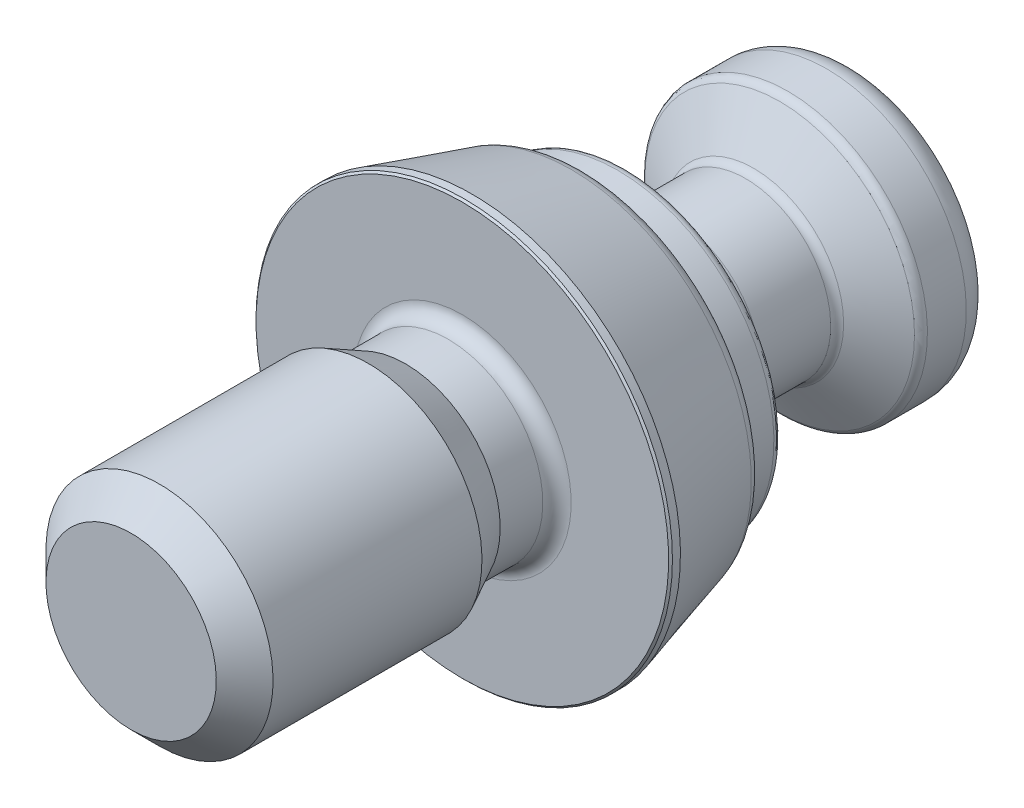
ISO-10303-21;
HEADER;
FILE_DESCRIPTION(('STEP AP214'),'2;1');
FILE_NAME('part.step','',(''),(''),'','','');
FILE_SCHEMA(('AUTOMOTIVE_DESIGN { 1 0 10303 214 1 1 1 1 }'));
ENDSEC;
DATA;
#1=APPLICATION_CONTEXT('core data for automotive mechanical design processes');
#2=APPLICATION_PROTOCOL_DEFINITION('international standard','automotive_design',2000,#1);
#3=PRODUCT_CONTEXT('',#1,'mechanical');
#4=PRODUCT('Part','Part','',(#3));
#5=PRODUCT_RELATED_PRODUCT_CATEGORY('part','',(#4));
#6=PRODUCT_DEFINITION_FORMATION('','',#4);
#7=PRODUCT_DEFINITION_CONTEXT('part definition',#1,'design');
#8=PRODUCT_DEFINITION('design','',#6,#7);
#9=PRODUCT_DEFINITION_SHAPE('','',#8);
#10=(LENGTH_UNIT() NAMED_UNIT(*) SI_UNIT(.MILLI.,.METRE.));
#11=(NAMED_UNIT(*) PLANE_ANGLE_UNIT() SI_UNIT($,.RADIAN.));
#12=(NAMED_UNIT(*) SI_UNIT($,.STERADIAN.) SOLID_ANGLE_UNIT());
#13=UNCERTAINTY_MEASURE_WITH_UNIT(LENGTH_MEASURE(1.E-05),#10,'distance_accuracy_value','');
#14=(GEOMETRIC_REPRESENTATION_CONTEXT(3) GLOBAL_UNCERTAINTY_ASSIGNED_CONTEXT((#13)) GLOBAL_UNIT_ASSIGNED_CONTEXT((#10,
#11,#12)) REPRESENTATION_CONTEXT('',''));
#15=CARTESIAN_POINT('',(0.,0.,0.));
#16=DIRECTION('',(0.,0.,1.));
#17=DIRECTION('',(1.,0.,0.));
#18=AXIS2_PLACEMENT_3D('',#15,#16,#17);
#19=CARTESIAN_POINT('',(0.,0.,-13.));
#20=DIRECTION('',(0.,0.,-1.));
#21=DIRECTION('',(0.,1.,0.));
#22=AXIS2_PLACEMENT_3D('',#19,#20,#21);
#23=CYLINDRICAL_SURFACE('',#22,16.5);
#24=CARTESIAN_POINT('',(0.,0.,-13.4));
#25=DIRECTION('',(0.,0.,1.));
#26=DIRECTION('',(0.,-1.,0.));
#27=AXIS2_PLACEMENT_3D('',#24,#25,#26);
#28=CIRCLE('',#27,16.5);
#29=CARTESIAN_POINT('',(0.,-16.5,-13.4000000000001));
#30=VERTEX_POINT('',#29);
#31=EDGE_CURVE('E22',#30,#30,#28,.F.);
#32=ORIENTED_EDGE('',*,*,#31,.T.);
#33=EDGE_LOOP('',(#32));
#34=FACE_BOUND('',#33,.T.);
#35=CARTESIAN_POINT('',(0.,0.,-16.4226497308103));
#36=DIRECTION('',(0.,0.,-1.));
#37=DIRECTION('',(0.,1.,0.));
#38=AXIS2_PLACEMENT_3D('',#35,#36,#37);
#39=CIRCLE('',#38,16.5);
#40=CARTESIAN_POINT('',(0.,16.5,-16.4226497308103));
#41=VERTEX_POINT('',#40);
#42=EDGE_CURVE('E126',#41,#41,#39,.F.);
#43=ORIENTED_EDGE('',*,*,#42,.T.);
#44=EDGE_LOOP('',(#43));
#45=FACE_BOUND('',#44,.T.);
#46=ADVANCED_FACE('F14',(#34,#45),#23,.T.);
#47=CARTESIAN_POINT('',(0.,0.,-13.));
#48=DIRECTION('',(0.,0.,1.));
#49=DIRECTION('',(0.,-1.,0.));
#50=AXIS2_PLACEMENT_3D('',#47,#48,#49);
#51=CYLINDRICAL_SURFACE('',#50,9.);
#52=CARTESIAN_POINT('',(0.,0.,-22.4848275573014));
#53=DIRECTION('',(0.,0.,1.));
#54=DIRECTION('',(0.,-1.,0.));
#55=AXIS2_PLACEMENT_3D('',#52,#53,#54);
#56=CIRCLE('',#55,9.);
#57=CARTESIAN_POINT('',(0.,-8.99999999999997,-22.4848275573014));
#58=VERTEX_POINT('',#57);
#59=EDGE_CURVE('E117',#58,#58,#56,.F.);
#60=ORIENTED_EDGE('',*,*,#59,.T.);
#61=EDGE_LOOP('',(#60));
#62=FACE_BOUND('',#61,.T.);
#63=CARTESIAN_POINT('',(0.,0.,-29.9226497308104));
#64=DIRECTION('',(0.,0.,1.));
#65=DIRECTION('',(0.,-1.,0.));
#66=AXIS2_PLACEMENT_3D('',#63,#64,#65);
#67=CIRCLE('',#66,9.);
#68=CARTESIAN_POINT('',(0.,-8.99999999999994,-29.9226497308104));
#69=VERTEX_POINT('',#68);
#70=EDGE_CURVE('E96',#69,#69,#67,.T.);
#71=ORIENTED_EDGE('',*,*,#70,.T.);
#72=EDGE_LOOP('',(#71));
#73=FACE_BOUND('',#72,.T.);
#74=ADVANCED_FACE('F229',(#62,#73),#51,.T.);
#75=CARTESIAN_POINT('',(0.,0.,-30.5));
#76=DIRECTION('',(0.,0.,-1.));
#77=DIRECTION('',(0.,1.,0.));
#78=AXIS2_PLACEMENT_3D('',#75,#76,#77);
#79=CONICAL_SURFACE('',#78,9.,1.0471975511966);
#80=CARTESIAN_POINT('',(0.,0.,-33.5310889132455));
#81=DIRECTION('',(0.,0.,1.));
#82=DIRECTION('',(0.,-1.,0.));
#83=AXIS2_PLACEMENT_3D('',#80,#81,#82);
#84=CIRCLE('',#83,14.25);
#85=CARTESIAN_POINT('',(0.,-14.2499999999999,-33.5310889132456));
#86=VERTEX_POINT('',#85);
#87=EDGE_CURVE('E102',#86,#86,#84,.T.);
#88=ORIENTED_EDGE('',*,*,#87,.T.);
#89=EDGE_LOOP('',(#88));
#90=FACE_BOUND('',#89,.T.);
#91=CARTESIAN_POINT('',(0.,0.,-30.7886751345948));
#92=DIRECTION('',(0.,0.,-1.));
#93=DIRECTION('',(0.,1.,0.));
#94=AXIS2_PLACEMENT_3D('',#91,#92,#93);
#95=CIRCLE('',#94,9.5);
#96=CARTESIAN_POINT('',(0.,9.50000000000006,-30.7886751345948));
#97=VERTEX_POINT('',#96);
#98=EDGE_CURVE('E99',#97,#97,#95,.T.);
#99=ORIENTED_EDGE('',*,*,#98,.T.);
#100=EDGE_LOOP('',(#99));
#101=FACE_BOUND('',#100,.T.);
#102=ADVANCED_FACE('F236',(#90,#101),#79,.T.);
#103=CARTESIAN_POINT('',(0.,0.,-13.));
#104=DIRECTION('',(0.,0.,1.));
#105=DIRECTION('',(0.,-1.,0.));
#106=AXIS2_PLACEMENT_3D('',#103,#104,#105);
#107=CYLINDRICAL_SURFACE('',#106,14.75);
#108=CARTESIAN_POINT('',(0.,0.,-38.5));
#109=DIRECTION('',(0.,0.,-1.));
#110=DIRECTION('',(0.,1.,0.));
#111=AXIS2_PLACEMENT_3D('',#108,#109,#110);
#112=CIRCLE('',#111,14.75);
#113=CARTESIAN_POINT('',(0.,14.7500000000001,-38.5));
#114=VERTEX_POINT('',#113);
#115=EDGE_CURVE('E108',#114,#114,#112,.F.);
#116=ORIENTED_EDGE('',*,*,#115,.T.);
#117=EDGE_LOOP('',(#116));
#118=FACE_BOUND('',#117,.T.);
#119=CARTESIAN_POINT('',(0.,0.,-34.39711431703));
#120=DIRECTION('',(0.,0.,-1.));
#121=DIRECTION('',(0.,1.,0.));
#122=AXIS2_PLACEMENT_3D('',#119,#120,#121);
#123=CIRCLE('',#122,14.75);
#124=CARTESIAN_POINT('',(0.,14.7500000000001,-34.39711431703));
#125=VERTEX_POINT('',#124);
#126=EDGE_CURVE('E105',#125,#125,#123,.T.);
#127=ORIENTED_EDGE('',*,*,#126,.T.);
#128=EDGE_LOOP('',(#127));
#129=FACE_BOUND('',#128,.T.);
#130=ADVANCED_FACE('F356',(#118,#129),#107,.T.);
#131=CARTESIAN_POINT('',(0.,0.,-17.));
#132=DIRECTION('',(0.,0.,1.));
#133=DIRECTION('',(0.,-1.,0.));
#134=AXIS2_PLACEMENT_3D('',#131,#132,#133);
#135=CONICAL_SURFACE('',#134,16.5,1.0471975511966);
#136=CARTESIAN_POINT('',(0.,0.,-17.2886751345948));
#137=DIRECTION('',(0.,0.,-1.));
#138=DIRECTION('',(0.,1.,0.));
#139=AXIS2_PLACEMENT_3D('',#136,#137,#138);
#140=CIRCLE('',#139,16.);
#141=CARTESIAN_POINT('',(0.,16.,-17.2886751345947));
#142=VERTEX_POINT('',#141);
#143=EDGE_CURVE('E129',#142,#142,#140,.T.);
#144=ORIENTED_EDGE('',*,*,#143,.T.);
#145=EDGE_LOOP('',(#144));
#146=FACE_BOUND('',#145,.T.);
#147=CARTESIAN_POINT('',(0.,0.,-20.7527767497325));
#148=DIRECTION('',(0.,0.,1.));
#149=DIRECTION('',(0.,-1.,0.));
#150=AXIS2_PLACEMENT_3D('',#147,#148,#149);
#151=CIRCLE('',#150,10.);
#152=CARTESIAN_POINT('',(0.,-9.99999999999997,-20.7527767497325));
#153=VERTEX_POINT('',#152);
#154=EDGE_CURVE('E114',#153,#153,#151,.T.);
#155=ORIENTED_EDGE('',*,*,#154,.T.);
#156=EDGE_LOOP('',(#155));
#157=FACE_BOUND('',#156,.T.);
#158=ADVANCED_FACE('F351',(#146,#157),#135,.T.);
#159=CARTESIAN_POINT('',(16.5,0.,-41.5));
#160=DIRECTION('',(0.,0.,-1.));
#161=DIRECTION('',(0.,1.,0.));
#162=AXIS2_PLACEMENT_3D('',#159,#160,#161);
#163=PLANE('',#162);
#164=CARTESIAN_POINT('',(0.,0.,-41.5));
#165=DIRECTION('',(0.,0.,1.));
#166=DIRECTION('',(0.,-1.,0.));
#167=AXIS2_PLACEMENT_3D('',#164,#165,#166);
#168=CIRCLE('',#167,5.);
#169=CARTESIAN_POINT('',(0.,-4.9999999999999,-41.5));
#170=VERTEX_POINT('',#169);
#171=EDGE_CURVE('E345',#170,#170,#168,.T.);
#172=ORIENTED_EDGE('',*,*,#171,.T.);
#173=EDGE_LOOP('',(#172));
#174=FACE_BOUND('',#173,.T.);
#175=CARTESIAN_POINT('',(0.,0.,-41.5));
#176=DIRECTION('',(0.,0.,-1.));
#177=DIRECTION('',(0.,1.,0.));
#178=AXIS2_PLACEMENT_3D('',#175,#176,#177);
#179=CIRCLE('',#178,11.75);
#180=CARTESIAN_POINT('',(0.,11.7500000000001,-41.5));
#181=VERTEX_POINT('',#180);
#182=EDGE_CURVE('E111',#181,#181,#179,.T.);
#183=ORIENTED_EDGE('',*,*,#182,.T.);
#184=EDGE_LOOP('',(#183));
#185=FACE_BOUND('',#184,.T.);
#186=ADVANCED_FACE('F243',(#174,#185),#163,.T.);
#187=CARTESIAN_POINT('',(0.,0.,-29.9226497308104));
#188=DIRECTION('',(0.,0.,1.));
#189=DIRECTION('',(0.,-1.,0.));
#190=AXIS2_PLACEMENT_3D('',#187,#188,#189);
#191=TOROIDAL_SURFACE('',#190,10.,1.);
#192=ORIENTED_EDGE('',*,*,#98,.F.);
#193=EDGE_LOOP('',(#192));
#194=FACE_BOUND('',#193,.T.);
#195=ORIENTED_EDGE('',*,*,#70,.F.);
#196=EDGE_LOOP('',(#195));
#197=FACE_BOUND('',#196,.T.);
#198=ADVANCED_FACE('F250',(#194,#197),#191,.F.);
#199=CARTESIAN_POINT('',(0.,0.,-34.39711431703));
#200=DIRECTION('',(0.,0.,-1.));
#201=DIRECTION('',(0.,1.,0.));
#202=AXIS2_PLACEMENT_3D('',#199,#200,#201);
#203=TOROIDAL_SURFACE('',#202,13.75,1.);
#204=ORIENTED_EDGE('',*,*,#126,.F.);
#205=EDGE_LOOP('',(#204));
#206=FACE_BOUND('',#205,.T.);
#207=ORIENTED_EDGE('',*,*,#87,.F.);
#208=EDGE_LOOP('',(#207));
#209=FACE_BOUND('',#208,.T.);
#210=ADVANCED_FACE('F253',(#206,#209),#203,.T.);
#211=CARTESIAN_POINT('',(0.,0.,-38.5));
#212=DIRECTION('',(0.,0.,-1.));
#213=DIRECTION('',(0.,1.,0.));
#214=AXIS2_PLACEMENT_3D('',#211,#212,#213);
#215=TOROIDAL_SURFACE('',#214,11.75,3.);
#216=ORIENTED_EDGE('',*,*,#182,.F.);
#217=EDGE_LOOP('',(#216));
#218=FACE_BOUND('',#217,.T.);
#219=ORIENTED_EDGE('',*,*,#115,.F.);
#220=EDGE_LOOP('',(#219));
#221=FACE_BOUND('',#220,.T.);
#222=ADVANCED_FACE('F257',(#218,#221),#215,.T.);
#223=CARTESIAN_POINT('',(0.,0.,-22.4848275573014));
#224=DIRECTION('',(0.,0.,1.));
#225=DIRECTION('',(0.,-1.,0.));
#226=AXIS2_PLACEMENT_3D('',#223,#224,#225);
#227=TOROIDAL_SURFACE('',#226,11.,2.);
#228=ORIENTED_EDGE('',*,*,#59,.F.);
#229=EDGE_LOOP('',(#228));
#230=FACE_BOUND('',#229,.T.);
#231=ORIENTED_EDGE('',*,*,#154,.F.);
#232=EDGE_LOOP('',(#231));
#233=FACE_BOUND('',#232,.T.);
#234=ADVANCED_FACE('F261',(#230,#233),#227,.F.);
#235=CARTESIAN_POINT('',(0.,0.,-16.4226497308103));
#236=DIRECTION('',(0.,0.,-1.));
#237=DIRECTION('',(0.,1.,0.));
#238=AXIS2_PLACEMENT_3D('',#235,#236,#237);
#239=TOROIDAL_SURFACE('',#238,15.5,1.);
#240=ORIENTED_EDGE('',*,*,#143,.F.);
#241=EDGE_LOOP('',(#240));
#242=FACE_BOUND('',#241,.T.);
#243=ORIENTED_EDGE('',*,*,#42,.F.);
#244=EDGE_LOOP('',(#243));
#245=FACE_BOUND('',#244,.T.);
#246=ADVANCED_FACE('F265',(#242,#245),#239,.T.);
#247=CARTESIAN_POINT('',(12.,0.,-13.));
#248=DIRECTION('',(0.,0.,1.));
#249=DIRECTION('',(0.,-1.,0.));
#250=AXIS2_PLACEMENT_3D('',#247,#248,#249);
#251=PLANE('',#250);
#252=CARTESIAN_POINT('',(0.,0.,-13.));
#253=DIRECTION('',(0.,0.,1.));
#254=DIRECTION('',(0.,-1.,0.));
#255=AXIS2_PLACEMENT_3D('',#252,#253,#254);
#256=CIRCLE('',#255,16.9);
#257=CARTESIAN_POINT('',(0.,-16.9,-13.0000000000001));
#258=VERTEX_POINT('',#257);
#259=EDGE_CURVE('E9',#258,#258,#256,.T.);
#260=ORIENTED_EDGE('',*,*,#259,.T.);
#261=EDGE_LOOP('',(#260));
#262=FACE_BOUND('',#261,.T.);
#263=CARTESIAN_POINT('',(0.,0.,-13.));
#264=DIRECTION('',(0.,0.,1.));
#265=DIRECTION('',(0.,-1.,0.));
#266=AXIS2_PLACEMENT_3D('',#263,#264,#265);
#267=CIRCLE('',#266,17.0652018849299);
#268=CARTESIAN_POINT('',(0.,-17.0652018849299,-13.0000000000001));
#269=VERTEX_POINT('',#268);
#270=EDGE_CURVE('E135',#269,#269,#267,.F.);
#271=ORIENTED_EDGE('',*,*,#270,.T.);
#272=EDGE_LOOP('',(#271));
#273=FACE_BOUND('',#272,.T.);
#274=ADVANCED_FACE('F273',(#262,#273),#251,.F.);
#275=CARTESIAN_POINT('',(0.,0.,-13.));
#276=DIRECTION('',(0.,0.,1.));
#277=DIRECTION('',(0.,-1.,0.));
#278=AXIS2_PLACEMENT_3D('',#275,#276,#277);
#279=CONICAL_SURFACE('',#278,18.5723099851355,0.279252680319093);
#280=CARTESIAN_POINT('',(0.,0.,-11.551274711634));
#281=DIRECTION('',(0.,0.,-1.));
#282=DIRECTION('',(0.,1.,0.));
#283=AXIS2_PLACEMENT_3D('',#280,#281,#282);
#284=CIRCLE('',#283,18.9877252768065);
#285=CARTESIAN_POINT('',(0.,18.9877252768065,-11.5512747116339));
#286=VERTEX_POINT('',#285);
#287=EDGE_CURVE('E132',#286,#286,#284,.F.);
#288=ORIENTED_EDGE('',*,*,#287,.T.);
#289=EDGE_LOOP('',(#288));
#290=FACE_BOUND('',#289,.T.);
#291=CARTESIAN_POINT('',(0.,0.,-1.04622433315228));
#292=DIRECTION('',(0.,0.,1.));
#293=DIRECTION('',(0.,-1.,0.));
#294=AXIS2_PLACEMENT_3D('',#291,#292,#293);
#295=CIRCLE('',#294,22.);
#296=CARTESIAN_POINT('',(0.,-22.,-1.04622433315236));
#297=VERTEX_POINT('',#296);
#298=EDGE_CURVE('E148',#297,#297,#295,.T.);
#299=ORIENTED_EDGE('',*,*,#298,.F.);
#300=EDGE_LOOP('',(#299));
#301=FACE_BOUND('',#300,.T.);
#302=ADVANCED_FACE('F303',(#290,#301),#279,.T.);
#303=CARTESIAN_POINT('',(0.,0.,-0.919969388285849));
#304=DIRECTION('',(0.,0.,1.));
#305=DIRECTION('',(0.,-1.,0.));
#306=AXIS2_PLACEMENT_3D('',#303,#304,#305);
#307=CYLINDRICAL_SURFACE('',#306,22.);
#308=CARTESIAN_POINT('',(0.,0.,-0.199999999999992));
#309=DIRECTION('',(0.,0.,-1.));
#310=DIRECTION('',(0.,1.,0.));
#311=AXIS2_PLACEMENT_3D('',#308,#309,#310);
#312=CIRCLE('',#311,22.);
#313=CARTESIAN_POINT('',(0.,22.,-0.199999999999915));
#314=VERTEX_POINT('',#313);
#315=EDGE_CURVE('E141',#314,#314,#312,.T.);
#316=ORIENTED_EDGE('',*,*,#315,.T.);
#317=EDGE_LOOP('',(#316));
#318=FACE_BOUND('',#317,.T.);
#319=ORIENTED_EDGE('',*,*,#298,.T.);
#320=EDGE_LOOP('',(#319));
#321=FACE_BOUND('',#320,.T.);
#322=ADVANCED_FACE('F295',(#318,#321),#307,.T.);
#323=CARTESIAN_POINT('',(12.,0.,0.));
#324=DIRECTION('',(0.,0.,-1.));
#325=DIRECTION('',(0.,1.,0.));
#326=AXIS2_PLACEMENT_3D('',#323,#324,#325);
#327=PLANE('',#326);
#328=CARTESIAN_POINT('',(0.,0.,0.));
#329=DIRECTION('',(0.,0.,-1.));
#330=DIRECTION('',(0.,1.,0.));
#331=AXIS2_PLACEMENT_3D('',#328,#329,#330);
#332=CIRCLE('',#331,11.5);
#333=CARTESIAN_POINT('',(0.,11.5,0.));
#334=VERTEX_POINT('',#333);
#335=EDGE_CURVE('E144',#334,#334,#332,.T.);
#336=ORIENTED_EDGE('',*,*,#335,.T.);
#337=EDGE_LOOP('',(#336));
#338=FACE_BOUND('',#337,.T.);
#339=CARTESIAN_POINT('',(0.,0.,0.));
#340=DIRECTION('',(0.,0.,-1.));
#341=DIRECTION('',(0.,1.,0.));
#342=AXIS2_PLACEMENT_3D('',#339,#340,#341);
#343=CIRCLE('',#342,21.8);
#344=CARTESIAN_POINT('',(0.,21.8,0.));
#345=VERTEX_POINT('',#344);
#346=EDGE_CURVE('E138',#345,#345,#343,.F.);
#347=ORIENTED_EDGE('',*,*,#346,.T.);
#348=EDGE_LOOP('',(#347));
#349=FACE_BOUND('',#348,.T.);
#350=ADVANCED_FACE('F279',(#338,#349),#327,.F.);
#351=CARTESIAN_POINT('',(0.,0.,-11.));
#352=DIRECTION('',(0.,0.,1.));
#353=DIRECTION('',(0.,-1.,0.));
#354=AXIS2_PLACEMENT_3D('',#351,#352,#353);
#355=TOROIDAL_SURFACE('',#354,17.0652018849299,2.);
#356=ORIENTED_EDGE('',*,*,#270,.F.);
#357=EDGE_LOOP('',(#356));
#358=FACE_BOUND('',#357,.T.);
#359=ORIENTED_EDGE('',*,*,#287,.F.);
#360=EDGE_LOOP('',(#359));
#361=FACE_BOUND('',#360,.T.);
#362=ADVANCED_FACE('F275',(#358,#361),#355,.T.);
#363=CARTESIAN_POINT('',(0.,0.,0.));
#364=DIRECTION('',(0.,0.,-1.));
#365=DIRECTION('',(0.,1.,0.));
#366=AXIS2_PLACEMENT_3D('',#363,#364,#365);
#367=CONICAL_SURFACE('',#366,21.8,0.785398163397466);
#368=ORIENTED_EDGE('',*,*,#315,.F.);
#369=EDGE_LOOP('',(#368));
#370=FACE_BOUND('',#369,.T.);
#371=ORIENTED_EDGE('',*,*,#346,.F.);
#372=EDGE_LOOP('',(#371));
#373=FACE_BOUND('',#372,.T.);
#374=ADVANCED_FACE('F278',(#370,#373),#367,.T.);
#375=CARTESIAN_POINT('',(0.,0.,-15.1189031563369));
#376=DIRECTION('',(0.,0.,-1.));
#377=DIRECTION('',(0.,1.,0.));
#378=AXIS2_PLACEMENT_3D('',#375,#376,#377);
#379=CYLINDRICAL_SURFACE('',#378,10.);
#380=CARTESIAN_POINT('',(0.,0.,1.5));
#381=DIRECTION('',(0.,0.,-1.));
#382=DIRECTION('',(0.,1.,0.));
#383=AXIS2_PLACEMENT_3D('',#380,#381,#382);
#384=CIRCLE('',#383,10.);
#385=CARTESIAN_POINT('',(0.,9.99999999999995,1.50000000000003));
#386=VERTEX_POINT('',#385);
#387=EDGE_CURVE('E75',#386,#386,#384,.F.);
#388=ORIENTED_EDGE('',*,*,#387,.T.);
#389=EDGE_LOOP('',(#388));
#390=FACE_BOUND('',#389,.T.);
#391=CARTESIAN_POINT('',(0.,0.,6.));
#392=DIRECTION('',(0.,0.,-1.));
#393=DIRECTION('',(0.,1.,0.));
#394=AXIS2_PLACEMENT_3D('',#391,#392,#393);
#395=CIRCLE('',#394,10.);
#396=CARTESIAN_POINT('',(0.,9.99999999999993,6.00000000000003));
#397=VERTEX_POINT('',#396);
#398=EDGE_CURVE('E81',#397,#397,#395,.T.);
#399=ORIENTED_EDGE('',*,*,#398,.T.);
#400=EDGE_LOOP('',(#399));
#401=FACE_BOUND('',#400,.T.);
#402=ADVANCED_FACE('F282',(#390,#401),#379,.T.);
#403=CARTESIAN_POINT('',(0.,0.,10.9065262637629));
#404=DIRECTION('',(0.,0.,1.));
#405=DIRECTION('',(0.,-1.,0.));
#406=AXIS2_PLACEMENT_3D('',#403,#404,#405);
#407=CONICAL_SURFACE('',#406,12.5,0.471238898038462);
#408=CARTESIAN_POINT('',(0.,0.,9.92522101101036));
#409=DIRECTION('',(0.,0.,1.));
#410=DIRECTION('',(0.,-1.,0.));
#411=AXIS2_PLACEMENT_3D('',#408,#409,#410);
#412=CIRCLE('',#411,12.);
#413=CARTESIAN_POINT('',(0.,-12.0000000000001,9.92522101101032));
#414=VERTEX_POINT('',#413);
#415=EDGE_CURVE('E145',#414,#414,#412,.F.);
#416=ORIENTED_EDGE('',*,*,#415,.T.);
#417=EDGE_LOOP('',(#416));
#418=FACE_BOUND('',#417,.T.);
#419=ORIENTED_EDGE('',*,*,#398,.F.);
#420=EDGE_LOOP('',(#419));
#421=FACE_BOUND('',#420,.T.);
#422=ADVANCED_FACE('F167',(#418,#421),#407,.T.);
#423=CARTESIAN_POINT('',(0.,-1.6759110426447E-13,35.));
#424=DIRECTION('',(0.,0.,1.));
#425=DIRECTION('',(0.,-1.,0.));
#426=AXIS2_PLACEMENT_3D('',#423,#424,#425);
#427=PLANE('',#426);
#428=CARTESIAN_POINT('',(0.,-1.6759110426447E-13,35.));
#429=DIRECTION('',(0.,0.,1.));
#430=DIRECTION('',(0.,-1.,0.));
#431=AXIS2_PLACEMENT_3D('',#428,#429,#430);
#432=CIRCLE('',#431,9.);
#433=CARTESIAN_POINT('',(0.,-9.00000000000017,35.));
#434=VERTEX_POINT('',#433);
#435=EDGE_CURVE('E123',#434,#434,#432,.T.);
#436=ORIENTED_EDGE('',*,*,#435,.T.);
#437=EDGE_LOOP('',(#436));
#438=FACE_BOUND('',#437,.T.);
#439=ADVANCED_FACE('F269',(#438),#427,.T.);
#440=CARTESIAN_POINT('',(0.,-1.57116660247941E-13,32.));
#441=DIRECTION('',(0.,0.,-1.));
#442=DIRECTION('',(0.,1.,0.));
#443=AXIS2_PLACEMENT_3D('',#440,#441,#442);
#444=CONICAL_SURFACE('',#443,12.,0.785398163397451);
#445=ORIENTED_EDGE('',*,*,#435,.F.);
#446=EDGE_LOOP('',(#445));
#447=FACE_BOUND('',#446,.T.);
#448=CARTESIAN_POINT('',(0.,-1.57116660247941E-13,32.));
#449=DIRECTION('',(0.,0.,1.));
#450=DIRECTION('',(0.,-1.,0.));
#451=AXIS2_PLACEMENT_3D('',#448,#449,#450);
#452=CIRCLE('',#451,12.);
#453=CARTESIAN_POINT('',(0.,-12.0000000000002,32.));
#454=VERTEX_POINT('',#453);
#455=EDGE_CURVE('E120',#454,#454,#452,.F.);
#456=ORIENTED_EDGE('',*,*,#455,.F.);
#457=EDGE_LOOP('',(#456));
#458=FACE_BOUND('',#457,.T.);
#459=ADVANCED_FACE('F248',(#447,#458),#444,.T.);
#460=CARTESIAN_POINT('',(0.,0.,-13.));
#461=DIRECTION('',(0.,0.,-1.));
#462=DIRECTION('',(0.,1.,0.));
#463=AXIS2_PLACEMENT_3D('',#460,#461,#462);
#464=CYLINDRICAL_SURFACE('',#463,12.);
#465=ORIENTED_EDGE('',*,*,#415,.F.);
#466=EDGE_LOOP('',(#465));
#467=FACE_BOUND('',#466,.T.);
#468=ORIENTED_EDGE('',*,*,#455,.T.);
#469=EDGE_LOOP('',(#468));
#470=FACE_BOUND('',#469,.T.);
#471=ADVANCED_FACE('F245',(#467,#470),#464,.T.);
#472=CARTESIAN_POINT('',(0.,0.,1.5));
#473=DIRECTION('',(0.,0.,-1.));
#474=DIRECTION('',(0.,1.,0.));
#475=AXIS2_PLACEMENT_3D('',#472,#473,#474);
#476=TOROIDAL_SURFACE('',#475,11.5,1.5);
#477=ORIENTED_EDGE('',*,*,#387,.F.);
#478=EDGE_LOOP('',(#477));
#479=FACE_BOUND('',#478,.T.);
#480=ORIENTED_EDGE('',*,*,#335,.F.);
#481=EDGE_LOOP('',(#480));
#482=FACE_BOUND('',#481,.T.);
#483=ADVANCED_FACE('F165',(#479,#482),#476,.F.);
#484=CARTESIAN_POINT('',(0.,0.,-41.5));
#485=DIRECTION('',(0.,0.,-1.));
#486=DIRECTION('',(0.,1.,0.));
#487=AXIS2_PLACEMENT_3D('',#484,#485,#486);
#488=CONICAL_SURFACE('',#487,5.,1.0471975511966);
#489=ORIENTED_EDGE('',*,*,#171,.F.);
#490=EDGE_LOOP('',(#489));
#491=FACE_BOUND('',#490,.T.);
#492=CARTESIAN_POINT('',(4.61891762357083,-0.000199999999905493,-41.2799819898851));
#493=CARTESIAN_POINT('',(4.51743148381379,0.175579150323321,-41.2213676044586));
#494=CARTESIAN_POINT('',(4.4150693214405,0.352875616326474,-41.1680600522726));
#495=CARTESIAN_POINT('',(4.20857250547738,0.710538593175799,-41.0750114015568));
#496=CARTESIAN_POINT('',(4.10443418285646,0.890911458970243,-41.0353032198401));
#497=CARTESIAN_POINT('',(3.89744813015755,1.24942181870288,-40.9734919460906));
#498=CARTESIAN_POINT('',(3.79463224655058,1.42750415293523,-40.9509774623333));
#499=CARTESIAN_POINT('',(3.58851671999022,1.7845067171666,-40.9241003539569));
#500=CARTESIAN_POINT('',(3.48521782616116,1.96342564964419,-40.9197154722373));
#501=CARTESIAN_POINT('',(3.29219970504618,2.29774284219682,-40.9288398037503));
#502=CARTESIAN_POINT('',(3.20245157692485,2.45319115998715,-40.9401086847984));
#503=CARTESIAN_POINT('',(3.02354002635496,2.76307505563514,-40.9758237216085));
#504=CARTESIAN_POINT('',(2.93437722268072,2.91750956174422,-41.0002820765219));
#505=CARTESIAN_POINT('',(2.75509682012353,3.22803232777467,-41.0614257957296));
#506=CARTESIAN_POINT('',(2.66500191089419,3.38408128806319,-41.0983703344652));
#507=CARTESIAN_POINT('',(2.486155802,3.69385183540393,-41.1822198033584));
#508=CARTESIAN_POINT('',(2.39740231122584,3.84757739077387,-41.2291050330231));
#509=CARTESIAN_POINT('',(2.30928560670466,4.00020000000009,-41.2799819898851));
#510=B_SPLINE_CURVE_WITH_KNOTS('',3,(#492,#493,#494,#495,#496,#497,#498,#499,#500,#501,#502,
#503,#504,#505,#506,#507,#508,#509),.UNSPECIFIED.,.F.,.F.,(4,2,2,2,2,2,2,2,4),(0.,
0.634047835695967,1.26961969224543,1.88946157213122,2.50854226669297,3.04757825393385,
3.58711366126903,4.13861653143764,4.68903648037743),.UNSPECIFIED.);
#511=CARTESIAN_POINT('',(4.61880215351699,0.,-41.2799153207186));
#512=VERTEX_POINT('',#511);
#513=CARTESIAN_POINT('',(2.30940107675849,4.00000000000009,-41.2799153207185));
#514=VERTEX_POINT('',#513);
#515=EDGE_CURVE('E69',#512,#514,#510,.T.);
#516=ORIENTED_EDGE('',*,*,#515,.T.);
#517=CARTESIAN_POINT('',(-6.11536351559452,4.0000000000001,-42.8321612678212));
#518=CARTESIAN_POINT('',(-5.94136455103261,4.0000000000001,-42.7481138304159));
#519=CARTESIAN_POINT('',(-5.76695654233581,4.00000000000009,-42.6648982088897));
#520=CARTESIAN_POINT('',(-5.41710453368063,4.00000000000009,-42.5006003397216));
#521=CARTESIAN_POINT('',(-5.24166036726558,4.00000000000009,-42.4195184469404));
#522=CARTESIAN_POINT('',(-4.88857129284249,4.00000000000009,-42.2595308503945));
#523=CARTESIAN_POINT('',(-4.71091953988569,4.00000000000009,-42.1806401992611));
#524=CARTESIAN_POINT('',(-4.35417172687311,4.00000000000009,-42.0262076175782));
#525=CARTESIAN_POINT('',(-4.17507573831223,4.00000000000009,-41.9506655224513));
#526=CARTESIAN_POINT('',(-3.80974659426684,4.00000000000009,-41.8016107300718));
#527=CARTESIAN_POINT('',(-3.623460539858,4.00000000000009,-41.7282269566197));
#528=CARTESIAN_POINT('',(-3.24867678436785,4.00000000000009,-41.5872295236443));
#529=CARTESIAN_POINT('',(-3.06017883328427,4.00000000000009,-41.5196165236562));
#530=CARTESIAN_POINT('',(-2.68105362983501,4.00000000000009,-41.3920002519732));
#531=CARTESIAN_POINT('',(-2.49043188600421,4.00000000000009,-41.3319807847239));
#532=CARTESIAN_POINT('',(-2.1064563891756,4.00000000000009,-41.2215351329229));
#533=CARTESIAN_POINT('',(-1.91310354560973,4.00000000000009,-41.1711058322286));
#534=CARTESIAN_POINT('',(-1.52459990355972,4.00000000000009,-41.0825776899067));
#535=CARTESIAN_POINT('',(-1.32946366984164,4.00000000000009,-41.0444161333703));
#536=CARTESIAN_POINT('',(-0.936859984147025,4.00000000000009,-40.9826444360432));
#537=CARTESIAN_POINT('',(-0.739392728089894,4.00000000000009,-40.9590330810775));
#538=CARTESIAN_POINT('',(-0.345654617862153,4.00000000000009,-40.9285556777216));
#539=CARTESIAN_POINT('',(-0.149400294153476,4.00000000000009,-40.9214813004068));
#540=CARTESIAN_POINT('',(0.24300822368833,4.00000000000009,-40.9241343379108));
#541=CARTESIAN_POINT('',(0.439162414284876,4.00000000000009,-40.9338623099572));
#542=CARTESIAN_POINT('',(0.774833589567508,4.00000000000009,-40.9642118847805));
#543=CARTESIAN_POINT('',(0.914717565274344,4.00000000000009,-40.9809861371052));
#544=CARTESIAN_POINT('',(1.19339686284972,4.00000000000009,-41.0219863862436));
#545=CARTESIAN_POINT('',(1.33219202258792,4.00000000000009,-41.0462134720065));
#546=CARTESIAN_POINT('',(1.74679493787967,4.00000000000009,-41.1287935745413));
#547=CARTESIAN_POINT('',(2.02065290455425,4.00000000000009,-41.1970283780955));
#548=CARTESIAN_POINT('',(2.43006674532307,4.00000000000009,-41.314532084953));
#549=CARTESIAN_POINT('',(2.56776398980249,4.00000000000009,-41.3567577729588));
#550=CARTESIAN_POINT('',(2.84181962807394,4.00000000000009,-41.4453888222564));
#551=CARTESIAN_POINT('',(2.97817801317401,4.00000000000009,-41.4917942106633));
#552=CARTESIAN_POINT('',(3.24960349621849,4.00000000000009,-41.5880571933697));
#553=CARTESIAN_POINT('',(3.38467104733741,4.00000000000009,-41.6379135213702));
#554=CARTESIAN_POINT('',(3.65370081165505,4.00000000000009,-41.7405124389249));
#555=CARTESIAN_POINT('',(3.78766303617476,4.00000000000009,-41.7932549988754));
#556=CARTESIAN_POINT('',(4.09701986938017,4.00000000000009,-41.9182840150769));
#557=CARTESIAN_POINT('',(4.27205588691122,4.00000000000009,-41.991455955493));
#558=CARTESIAN_POINT('',(4.62071132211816,4.00000000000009,-42.141108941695));
#559=CARTESIAN_POINT('',(4.79433066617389,4.00000000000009,-42.2175901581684));
#560=CARTESIAN_POINT('',(5.14040670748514,4.00000000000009,-42.373213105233));
#561=CARTESIAN_POINT('',(5.31286319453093,4.00000000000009,-42.4523553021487));
#562=CARTESIAN_POINT('',(5.65677659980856,4.00000000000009,-42.6127855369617));
#563=CARTESIAN_POINT('',(5.82823349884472,4.00000000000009,-42.6940736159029));
#564=CARTESIAN_POINT('',(6.34165551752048,4.00000000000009,-42.9406928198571));
#565=CARTESIAN_POINT('',(6.68236404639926,4.00000000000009,-43.1086386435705));
#566=CARTESIAN_POINT('',(7.36139047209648,4.0000000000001,-43.4492937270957));
#567=CARTESIAN_POINT('',(7.69970828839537,4.0000000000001,-43.6220031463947));
#568=CARTESIAN_POINT('',(8.34749653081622,4.0000000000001,-43.9568309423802));
#569=CARTESIAN_POINT('',(8.65710289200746,4.0000000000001,-44.1186868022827));
#570=CARTESIAN_POINT('',(9.27517825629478,4.0000000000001,-44.4445752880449));
#571=CARTESIAN_POINT('',(9.5836472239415,4.0000000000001,-44.6086079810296));
#572=CARTESIAN_POINT('',(10.1989977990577,4.0000000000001,-44.937968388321));
#573=CARTESIAN_POINT('',(10.5058814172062,4.0000000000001,-45.1032923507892));
#574=CARTESIAN_POINT('',(11.11891782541,4.0000000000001,-45.4352539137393));
#575=CARTESIAN_POINT('',(11.4250706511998,4.0000000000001,-45.6018914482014));
#576=CARTESIAN_POINT('',(11.7309525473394,4.0000000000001,-45.7690213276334));
#577=B_SPLINE_CURVE_WITH_KNOTS('',3,(#517,#518,#519,#520,#521,#522,#523,#524,#525,#526,#527,
#528,#529,#530,#531,#532,#533,#534,#535,#536,#537,#538,#539,#540,#541,#542,#543,#544,#545,#546,
#547,#548,#549,#550,#551,#552,#553,#554,#555,#556,#557,#558,#559,#560,#561,#562,#563,#564,#565,
#566,#567,#568,#569,#570,#571,#572,#573,#574,#575,#576),.UNSPECIFIED.,.F.,.F.,(4,2,2,2,2,2,2,2,
2,2,2,2,2,2,2,2,2,2,2,2,2,2,2,2,2,2,2,2,2,4),(0.,0.579711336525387,1.15951848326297,
1.74263314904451,2.3257191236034,2.92630247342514,3.52695437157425,4.12630278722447,
4.72545612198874,5.32149588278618,5.91748589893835,6.50592633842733,7.09438629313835,
7.51683805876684,7.93935157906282,8.78488063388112,9.21692534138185,9.64897285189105,
10.0808626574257,10.512748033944,11.0818474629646,11.650976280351,12.220205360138,
12.7894453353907,13.9289401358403,15.0684731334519,16.1165460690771,17.1646513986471,
18.2103945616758,19.2560854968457),.UNSPECIFIED.);
#578=CARTESIAN_POINT('',(-2.30940107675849,4.00000000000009,-41.2799153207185));
#579=VERTEX_POINT('',#578);
#580=EDGE_CURVE('E82',#514,#579,#577,.F.);
#581=ORIENTED_EDGE('',*,*,#580,.T.);
#582=CARTESIAN_POINT('',(-2.30928560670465,4.00020000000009,-41.2799819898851));
#583=CARTESIAN_POINT('',(-2.41077174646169,3.82442084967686,-41.2213676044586));
#584=CARTESIAN_POINT('',(-2.51313390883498,3.64712438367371,-41.1680600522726));
#585=CARTESIAN_POINT('',(-2.7196307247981,3.28946140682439,-41.0750114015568));
#586=CARTESIAN_POINT('',(-2.82376904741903,3.10908854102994,-41.0353032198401));
#587=CARTESIAN_POINT('',(-3.03075510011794,2.7505781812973,-40.9734919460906));
#588=CARTESIAN_POINT('',(-3.1335709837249,2.57249584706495,-40.9509774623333));
#589=CARTESIAN_POINT('',(-3.33968651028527,2.21549328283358,-40.9241003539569));
#590=CARTESIAN_POINT('',(-3.44298540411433,2.03657435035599,-40.9197154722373));
#591=CARTESIAN_POINT('',(-3.63600352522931,1.70225715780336,-40.9288398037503));
#592=CARTESIAN_POINT('',(-3.72575165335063,1.54680884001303,-40.9401086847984));
#593=CARTESIAN_POINT('',(-3.90466320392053,1.23692494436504,-40.9758237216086));
#594=CARTESIAN_POINT('',(-3.99382600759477,1.08249043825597,-41.0002820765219));
#595=CARTESIAN_POINT('',(-4.17310641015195,0.771967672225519,-41.0614257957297));
#596=CARTESIAN_POINT('',(-4.2632013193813,0.615918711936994,-41.0983703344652));
#597=CARTESIAN_POINT('',(-4.44204742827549,0.306148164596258,-41.1822198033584));
#598=CARTESIAN_POINT('',(-4.53080091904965,0.152422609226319,-41.2291050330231));
#599=CARTESIAN_POINT('',(-4.61891762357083,-0.000199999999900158,-41.2799819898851));
#600=B_SPLINE_CURVE_WITH_KNOTS('',3,(#582,#583,#584,#585,#586,#587,#588,#589,#590,#591,#592,
#593,#594,#595,#596,#597,#598,#599),.UNSPECIFIED.,.F.,.F.,(4,2,2,2,2,2,2,2,4),(0.,
0.634047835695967,1.26961969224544,1.88946157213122,2.50854226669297,3.04757825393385,
3.58711366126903,4.13861653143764,4.68903648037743),.UNSPECIFIED.);
#601=CARTESIAN_POINT('',(-4.61880215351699,1.00248245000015E-13,-41.2799153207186));
#602=VERTEX_POINT('',#601);
#603=EDGE_CURVE('E188',#579,#602,#600,.T.);
#604=ORIENTED_EDGE('',*,*,#603,.T.);
#605=CARTESIAN_POINT('',(-4.61891762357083,0.000200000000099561,-41.2799819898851));
#606=CARTESIAN_POINT('',(-4.51743148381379,-0.175579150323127,-41.2213676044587));
#607=CARTESIAN_POINT('',(-4.4150693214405,-0.352875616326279,-41.1680600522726));
#608=CARTESIAN_POINT('',(-4.20857250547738,-0.710538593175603,-41.0750114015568));
#609=CARTESIAN_POINT('',(-4.10443418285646,-0.890911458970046,-41.0353032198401));
#610=CARTESIAN_POINT('',(-3.89744813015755,-1.24942181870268,-40.9734919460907));
#611=CARTESIAN_POINT('',(-3.79463224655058,-1.42750415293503,-40.9509774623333));
#612=CARTESIAN_POINT('',(-3.58851671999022,-1.7845067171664,-40.924100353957));
#613=CARTESIAN_POINT('',(-3.48521782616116,-1.96342564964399,-40.9197154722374));
#614=CARTESIAN_POINT('',(-3.29219970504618,-2.29774284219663,-40.9288398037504));
#615=CARTESIAN_POINT('',(-3.20245157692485,-2.45319115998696,-40.9401086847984));
#616=CARTESIAN_POINT('',(-3.02354002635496,-2.76307505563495,-40.9758237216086));
#617=CARTESIAN_POINT('',(-2.93437722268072,-2.91750956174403,-41.0002820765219));
#618=CARTESIAN_POINT('',(-2.75509682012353,-3.22803232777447,-41.0614257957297));
#619=CARTESIAN_POINT('',(-2.66500191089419,-3.38408128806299,-41.0983703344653));
#620=CARTESIAN_POINT('',(-2.486155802,-3.69385183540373,-41.1822198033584));
#621=CARTESIAN_POINT('',(-2.39740231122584,-3.84757739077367,-41.2291050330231));
#622=CARTESIAN_POINT('',(-2.30928560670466,-4.00019999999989,-41.2799819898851));
#623=B_SPLINE_CURVE_WITH_KNOTS('',3,(#605,#606,#607,#608,#609,#610,#611,#612,#613,#614,#615,
#616,#617,#618,#619,#620,#621,#622),.UNSPECIFIED.,.F.,.F.,(4,2,2,2,2,2,2,2,4),(0.,
0.634047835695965,1.26961969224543,1.88946157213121,2.50854226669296,3.04757825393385,
3.58711366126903,4.13861653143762,4.68903648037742),.UNSPECIFIED.);
#624=CARTESIAN_POINT('',(-2.30940107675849,-3.99999999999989,-41.2799153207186));
#625=VERTEX_POINT('',#624);
#626=EDGE_CURVE('E181',#602,#625,#623,.T.);
#627=ORIENTED_EDGE('',*,*,#626,.T.);
#628=CARTESIAN_POINT('',(-6.11536351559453,-3.99999999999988,-42.8321612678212));
#629=CARTESIAN_POINT('',(-5.94136455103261,-3.99999999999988,-42.7481138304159));
#630=CARTESIAN_POINT('',(-5.7669565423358,-3.99999999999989,-42.6648982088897));
#631=CARTESIAN_POINT('',(-5.41710453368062,-3.99999999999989,-42.5006003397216));
#632=CARTESIAN_POINT('',(-5.24166036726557,-3.99999999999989,-42.4195184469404));
#633=CARTESIAN_POINT('',(-4.88857129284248,-3.99999999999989,-42.2595308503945));
#634=CARTESIAN_POINT('',(-4.71091953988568,-3.99999999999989,-42.1806401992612));
#635=CARTESIAN_POINT('',(-4.35417172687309,-3.99999999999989,-42.0262076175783));
#636=CARTESIAN_POINT('',(-4.17507573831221,-3.99999999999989,-41.9506655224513));
#637=CARTESIAN_POINT('',(-3.80974659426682,-3.99999999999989,-41.8016107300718));
#638=CARTESIAN_POINT('',(-3.62346053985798,-3.99999999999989,-41.7282269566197));
#639=CARTESIAN_POINT('',(-3.24867678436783,-3.99999999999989,-41.5872295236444));
#640=CARTESIAN_POINT('',(-3.06017883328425,-3.99999999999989,-41.5196165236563));
#641=CARTESIAN_POINT('',(-2.681053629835,-3.99999999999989,-41.3920002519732));
#642=CARTESIAN_POINT('',(-2.4904318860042,-3.99999999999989,-41.331980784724));
#643=CARTESIAN_POINT('',(-2.10645638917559,-3.99999999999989,-41.2215351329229));
#644=CARTESIAN_POINT('',(-1.91310354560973,-3.9999999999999,-41.1711058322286));
#645=CARTESIAN_POINT('',(-1.52459990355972,-3.9999999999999,-41.0825776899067));
#646=CARTESIAN_POINT('',(-1.32946366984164,-3.99999999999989,-41.0444161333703));
#647=CARTESIAN_POINT('',(-0.936859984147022,-3.99999999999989,-40.9826444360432));
#648=CARTESIAN_POINT('',(-0.739392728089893,-3.99999999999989,-40.9590330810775));
#649=CARTESIAN_POINT('',(-0.345654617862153,-3.99999999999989,-40.9285556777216));
#650=CARTESIAN_POINT('',(-0.149400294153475,-3.99999999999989,-40.9214813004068));
#651=CARTESIAN_POINT('',(0.24300822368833,-3.99999999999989,-40.9241343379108));
#652=CARTESIAN_POINT('',(0.439162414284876,-3.9999999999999,-40.9338623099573));
#653=CARTESIAN_POINT('',(0.774833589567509,-3.9999999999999,-40.9642118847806));
#654=CARTESIAN_POINT('',(0.914717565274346,-3.99999999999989,-40.9809861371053));
#655=CARTESIAN_POINT('',(1.19339686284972,-3.99999999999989,-41.0219863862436));
#656=CARTESIAN_POINT('',(1.33219202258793,-3.99999999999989,-41.0462134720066));
#657=CARTESIAN_POINT('',(1.74679493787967,-3.99999999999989,-41.1287935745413));
#658=CARTESIAN_POINT('',(2.02065290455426,-3.99999999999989,-41.1970283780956));
#659=CARTESIAN_POINT('',(2.43006674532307,-3.99999999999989,-41.314532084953));
#660=CARTESIAN_POINT('',(2.56776398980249,-3.99999999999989,-41.3567577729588));
#661=CARTESIAN_POINT('',(2.84181962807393,-3.99999999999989,-41.4453888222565));
#662=CARTESIAN_POINT('',(2.97817801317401,-3.99999999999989,-41.4917942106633));
#663=CARTESIAN_POINT('',(3.24960349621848,-3.99999999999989,-41.5880571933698));
#664=CARTESIAN_POINT('',(3.38467104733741,-3.99999999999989,-41.6379135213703));
#665=CARTESIAN_POINT('',(3.65370081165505,-3.99999999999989,-41.740512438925));
#666=CARTESIAN_POINT('',(3.78766303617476,-3.99999999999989,-41.7932549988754));
#667=CARTESIAN_POINT('',(4.09701986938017,-3.99999999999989,-41.9182840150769));
#668=CARTESIAN_POINT('',(4.27205588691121,-3.99999999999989,-41.991455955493));
#669=CARTESIAN_POINT('',(4.62071132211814,-3.99999999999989,-42.141108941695));
#670=CARTESIAN_POINT('',(4.79433066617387,-3.99999999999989,-42.2175901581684));
#671=CARTESIAN_POINT('',(5.14040670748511,-3.99999999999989,-42.3732131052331));
#672=CARTESIAN_POINT('',(5.31286319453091,-3.99999999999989,-42.4523553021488));
#673=CARTESIAN_POINT('',(5.65677659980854,-3.99999999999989,-42.6127855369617));
#674=CARTESIAN_POINT('',(5.8282334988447,-3.99999999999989,-42.6940736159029));
#675=CARTESIAN_POINT('',(6.34165551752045,-3.99999999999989,-42.9406928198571));
#676=CARTESIAN_POINT('',(6.68236404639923,-3.99999999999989,-43.1086386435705));
#677=CARTESIAN_POINT('',(7.36139047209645,-3.99999999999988,-43.4492937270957));
#678=CARTESIAN_POINT('',(7.69970828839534,-3.99999999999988,-43.6220031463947));
#679=CARTESIAN_POINT('',(8.34749653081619,-3.99999999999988,-43.9568309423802));
#680=CARTESIAN_POINT('',(8.65710289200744,-3.99999999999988,-44.1186868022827));
#681=CARTESIAN_POINT('',(9.27517825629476,-3.99999999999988,-44.4445752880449));
#682=CARTESIAN_POINT('',(9.58364722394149,-3.99999999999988,-44.6086079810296));
#683=CARTESIAN_POINT('',(10.1989977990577,-3.99999999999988,-44.937968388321));
#684=CARTESIAN_POINT('',(10.5058814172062,-3.99999999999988,-45.1032923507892));
#685=CARTESIAN_POINT('',(11.11891782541,-3.99999999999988,-45.4352539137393));
#686=CARTESIAN_POINT('',(11.4250706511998,-3.99999999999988,-45.6018914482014));
#687=CARTESIAN_POINT('',(11.7309525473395,-3.99999999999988,-45.7690213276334));
#688=B_SPLINE_CURVE_WITH_KNOTS('',3,(#628,#629,#630,#631,#632,#633,#634,#635,#636,#637,#638,
#639,#640,#641,#642,#643,#644,#645,#646,#647,#648,#649,#650,#651,#652,#653,#654,#655,#656,#657,
#658,#659,#660,#661,#662,#663,#664,#665,#666,#667,#668,#669,#670,#671,#672,#673,#674,#675,#676,
#677,#678,#679,#680,#681,#682,#683,#684,#685,#686,#687),.UNSPECIFIED.,.F.,.F.,(4,2,2,2,2,2,2,2,
2,2,2,2,2,2,2,2,2,2,2,2,2,2,2,2,2,2,2,2,2,4),(0.,0.579711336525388,1.15951848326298,
1.74263314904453,2.32571912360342,2.92630247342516,3.52695437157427,4.12630278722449,
4.72545612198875,5.32149588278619,5.91748589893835,6.50592633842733,7.09438629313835,
7.51683805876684,7.93935157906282,8.78488063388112,9.21692534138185,9.64897285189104,
10.0808626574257,10.512748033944,11.0818474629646,11.6509762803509,12.220205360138,
12.7894453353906,13.9289401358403,15.0684731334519,16.1165460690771,17.1646513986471,
18.2103945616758,19.2560854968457),.UNSPECIFIED.);
#689=CARTESIAN_POINT('',(2.30940107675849,-3.9999999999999,-41.2799153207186));
#690=VERTEX_POINT('',#689);
#691=EDGE_CURVE('E29',#625,#690,#688,.T.);
#692=ORIENTED_EDGE('',*,*,#691,.T.);
#693=CARTESIAN_POINT('',(2.30928560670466,-4.00019999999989,-41.2799819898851));
#694=CARTESIAN_POINT('',(2.4107717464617,-3.82442084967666,-41.2213676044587));
#695=CARTESIAN_POINT('',(2.51313390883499,-3.64712438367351,-41.1680600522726));
#696=CARTESIAN_POINT('',(2.71963072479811,-3.28946140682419,-41.0750114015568));
#697=CARTESIAN_POINT('',(2.82376904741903,-3.10908854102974,-41.0353032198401));
#698=CARTESIAN_POINT('',(3.03075510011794,-2.75057818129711,-40.9734919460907));
#699=CARTESIAN_POINT('',(3.1335709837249,-2.57249584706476,-40.9509774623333));
#700=CARTESIAN_POINT('',(3.33968651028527,-2.21549328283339,-40.924100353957));
#701=CARTESIAN_POINT('',(3.44298540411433,-2.0365743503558,-40.9197154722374));
#702=CARTESIAN_POINT('',(3.63600352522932,-1.70225715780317,-40.9288398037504));
#703=CARTESIAN_POINT('',(3.72575165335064,-1.54680884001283,-40.9401086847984));
#704=CARTESIAN_POINT('',(3.90466320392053,-1.23692494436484,-40.9758237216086));
#705=CARTESIAN_POINT('',(3.99382600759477,-1.08249043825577,-41.0002820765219));
#706=CARTESIAN_POINT('',(4.17310641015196,-0.77196767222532,-41.0614257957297));
#707=CARTESIAN_POINT('',(4.2632013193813,-0.615918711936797,-41.0983703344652));
#708=CARTESIAN_POINT('',(4.44204742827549,-0.306148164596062,-41.1822198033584));
#709=CARTESIAN_POINT('',(4.53080091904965,-0.152422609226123,-41.2291050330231));
#710=CARTESIAN_POINT('',(4.61891762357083,0.000200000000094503,-41.2799819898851));
#711=B_SPLINE_CURVE_WITH_KNOTS('',3,(#693,#694,#695,#696,#697,#698,#699,#700,#701,#702,#703,
#704,#705,#706,#707,#708,#709,#710),.UNSPECIFIED.,.F.,.F.,(4,2,2,2,2,2,2,2,4),(0.,
0.634047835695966,1.26961969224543,1.88946157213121,2.50854226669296,3.04757825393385,
3.58711366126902,4.13861653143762,4.68903648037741),.UNSPECIFIED.);
#712=EDGE_CURVE('E66',#690,#512,#711,.T.);
#713=ORIENTED_EDGE('',*,*,#712,.T.);
#714=EDGE_LOOP('',(#516,#581,#604,#627,#692,#713));
#715=FACE_BOUND('',#714,.T.);
#716=ADVANCED_FACE('F68',(#491,#715),#488,.F.);
#717=CARTESIAN_POINT('',(0.,0.,-36.));
#718=DIRECTION('',(0.,0.,-1.));
#719=DIRECTION('',(0.,1.,0.));
#720=AXIS2_PLACEMENT_3D('',#717,#718,#719);
#721=PLANE('',#720);
#722=DIRECTION('',(0.5,0.866025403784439,0.));
#723=VECTOR('',#722,1.);
#724=CARTESIAN_POINT('',(-4.61880215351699,0.,-36.));
#725=LINE('',#724,#723);
#726=CARTESIAN_POINT('',(-4.61880215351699,0.,-36.));
#727=VERTEX_POINT('',#726);
#728=CARTESIAN_POINT('',(-2.30940107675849,4.00000000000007,-36.));
#729=VERTEX_POINT('',#728);
#730=EDGE_CURVE('E92',#727,#729,#725,.T.);
#731=ORIENTED_EDGE('',*,*,#730,.T.);
#732=DIRECTION('',(1.,0.,0.));
#733=VECTOR('',#732,1.);
#734=CARTESIAN_POINT('',(-2.30940107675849,4.00000000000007,-36.));
#735=LINE('',#734,#733);
#736=CARTESIAN_POINT('',(2.30940107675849,4.00000000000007,-36.));
#737=VERTEX_POINT('',#736);
#738=EDGE_CURVE('E88',#729,#737,#735,.T.);
#739=ORIENTED_EDGE('',*,*,#738,.T.);
#740=DIRECTION('',(0.5,-0.866025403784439,0.));
#741=VECTOR('',#740,1.);
#742=CARTESIAN_POINT('',(2.30940107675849,4.00000000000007,-36.));
#743=LINE('',#742,#741);
#744=CARTESIAN_POINT('',(4.61880215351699,0.,-36.));
#745=VERTEX_POINT('',#744);
#746=EDGE_CURVE('E37',#737,#745,#743,.T.);
#747=ORIENTED_EDGE('',*,*,#746,.T.);
#748=DIRECTION('',(-0.5,-0.866025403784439,0.));
#749=VECTOR('',#748,1.);
#750=CARTESIAN_POINT('',(4.61880215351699,0.,-36.));
#751=LINE('',#750,#749);
#752=CARTESIAN_POINT('',(2.30940107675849,-3.99999999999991,-36.));
#753=VERTEX_POINT('',#752);
#754=EDGE_CURVE('E86',#745,#753,#751,.T.);
#755=ORIENTED_EDGE('',*,*,#754,.T.);
#756=DIRECTION('',(-1.,0.,0.));
#757=VECTOR('',#756,1.);
#758=CARTESIAN_POINT('',(2.30940107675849,-3.99999999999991,-36.));
#759=LINE('',#758,#757);
#760=CARTESIAN_POINT('',(-2.30940107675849,-3.99999999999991,-36.));
#761=VERTEX_POINT('',#760);
#762=EDGE_CURVE('E327',#753,#761,#759,.T.);
#763=ORIENTED_EDGE('',*,*,#762,.T.);
#764=DIRECTION('',(-0.5,0.866025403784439,0.));
#765=VECTOR('',#764,1.);
#766=CARTESIAN_POINT('',(-2.30940107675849,-3.99999999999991,-36.));
#767=LINE('',#766,#765);
#768=EDGE_CURVE('E330',#761,#727,#767,.T.);
#769=ORIENTED_EDGE('',*,*,#768,.T.);
#770=EDGE_LOOP('',(#731,#739,#747,#755,#763,#769));
#771=FACE_BOUND('',#770,.T.);
#772=ADVANCED_FACE('F164',(#771),#721,.T.);
#773=CARTESIAN_POINT('',(4.61880215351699,0.,-36.));
#774=DIRECTION('',(0.866025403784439,-0.5,0.));
#775=DIRECTION('',(0.5,0.866025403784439,0.));
#776=AXIS2_PLACEMENT_3D('',#773,#774,#775);
#777=PLANE('',#776);
#778=ORIENTED_EDGE('',*,*,#712,.F.);
#779=DIRECTION('',(0.,0.,-1.));
#780=VECTOR('',#779,1.);
#781=CARTESIAN_POINT('',(2.30940107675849,-3.99999999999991,-36.));
#782=LINE('',#781,#780);
#783=EDGE_CURVE('E87',#753,#690,#782,.T.);
#784=ORIENTED_EDGE('',*,*,#783,.F.);
#785=ORIENTED_EDGE('',*,*,#754,.F.);
#786=DIRECTION('',(0.,0.,-1.));
#787=VECTOR('',#786,1.);
#788=CARTESIAN_POINT('',(4.61880215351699,0.,-36.));
#789=LINE('',#788,#787);
#790=EDGE_CURVE('E78',#745,#512,#789,.T.);
#791=ORIENTED_EDGE('',*,*,#790,.T.);
#792=EDGE_LOOP('',(#778,#784,#785,#791));
#793=FACE_BOUND('',#792,.T.);
#794=ADVANCED_FACE('F84',(#793),#777,.F.);
#795=CARTESIAN_POINT('',(2.30940107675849,-3.99999999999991,-36.));
#796=DIRECTION('',(0.,-1.,0.));
#797=DIRECTION('',(1.,0.,0.));
#798=AXIS2_PLACEMENT_3D('',#795,#796,#797);
#799=PLANE('',#798);
#800=ORIENTED_EDGE('',*,*,#691,.F.);
#801=DIRECTION('',(0.,0.,-1.));
#802=VECTOR('',#801,1.);
#803=CARTESIAN_POINT('',(-2.30940107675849,-3.99999999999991,-36.));
#804=LINE('',#803,#802);
#805=EDGE_CURVE('E90',#761,#625,#804,.T.);
#806=ORIENTED_EDGE('',*,*,#805,.F.);
#807=ORIENTED_EDGE('',*,*,#762,.F.);
#808=ORIENTED_EDGE('',*,*,#783,.T.);
#809=EDGE_LOOP('',(#800,#806,#807,#808));
#810=FACE_BOUND('',#809,.T.);
#811=ADVANCED_FACE('F218',(#810),#799,.F.);
#812=CARTESIAN_POINT('',(-2.30940107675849,-3.99999999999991,-36.));
#813=DIRECTION('',(-0.866025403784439,-0.5,0.));
#814=DIRECTION('',(0.5,-0.866025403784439,0.));
#815=AXIS2_PLACEMENT_3D('',#812,#813,#814);
#816=PLANE('',#815);
#817=ORIENTED_EDGE('',*,*,#626,.F.);
#818=DIRECTION('',(0.,0.,-1.));
#819=VECTOR('',#818,1.);
#820=CARTESIAN_POINT('',(-4.61880215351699,0.,-36.));
#821=LINE('',#820,#819);
#822=EDGE_CURVE('E339',#727,#602,#821,.T.);
#823=ORIENTED_EDGE('',*,*,#822,.F.);
#824=ORIENTED_EDGE('',*,*,#768,.F.);
#825=ORIENTED_EDGE('',*,*,#805,.T.);
#826=EDGE_LOOP('',(#817,#823,#824,#825));
#827=FACE_BOUND('',#826,.T.);
#828=ADVANCED_FACE('F214',(#827),#816,.F.);
#829=CARTESIAN_POINT('',(-4.61880215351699,0.,-36.));
#830=DIRECTION('',(-0.866025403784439,0.5,0.));
#831=DIRECTION('',(-0.5,-0.866025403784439,0.));
#832=AXIS2_PLACEMENT_3D('',#829,#830,#831);
#833=PLANE('',#832);
#834=ORIENTED_EDGE('',*,*,#603,.F.);
#835=DIRECTION('',(0.,0.,-1.));
#836=VECTOR('',#835,1.);
#837=CARTESIAN_POINT('',(-2.30940107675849,4.00000000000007,-36.));
#838=LINE('',#837,#836);
#839=EDGE_CURVE('E336',#729,#579,#838,.T.);
#840=ORIENTED_EDGE('',*,*,#839,.F.);
#841=ORIENTED_EDGE('',*,*,#730,.F.);
#842=ORIENTED_EDGE('',*,*,#822,.T.);
#843=EDGE_LOOP('',(#834,#840,#841,#842));
#844=FACE_BOUND('',#843,.T.);
#845=ADVANCED_FACE('F209',(#844),#833,.F.);
#846=CARTESIAN_POINT('',(-2.30940107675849,4.00000000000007,-36.));
#847=DIRECTION('',(0.,1.,0.));
#848=DIRECTION('',(-1.,0.,0.));
#849=AXIS2_PLACEMENT_3D('',#846,#847,#848);
#850=PLANE('',#849);
#851=ORIENTED_EDGE('',*,*,#580,.F.);
#852=DIRECTION('',(0.,0.,-1.));
#853=VECTOR('',#852,1.);
#854=CARTESIAN_POINT('',(2.30940107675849,4.00000000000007,-36.));
#855=LINE('',#854,#853);
#856=EDGE_CURVE('E80',#737,#514,#855,.T.);
#857=ORIENTED_EDGE('',*,*,#856,.F.);
#858=ORIENTED_EDGE('',*,*,#738,.F.);
#859=ORIENTED_EDGE('',*,*,#839,.T.);
#860=EDGE_LOOP('',(#851,#857,#858,#859));
#861=FACE_BOUND('',#860,.T.);
#862=ADVANCED_FACE('F205',(#861),#850,.F.);
#863=CARTESIAN_POINT('',(2.30940107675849,4.00000000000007,-36.));
#864=DIRECTION('',(0.866025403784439,0.5,0.));
#865=DIRECTION('',(-0.5,0.866025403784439,0.));
#866=AXIS2_PLACEMENT_3D('',#863,#864,#865);
#867=PLANE('',#866);
#868=ORIENTED_EDGE('',*,*,#515,.F.);
#869=ORIENTED_EDGE('',*,*,#790,.F.);
#870=ORIENTED_EDGE('',*,*,#746,.F.);
#871=ORIENTED_EDGE('',*,*,#856,.T.);
#872=EDGE_LOOP('',(#868,#869,#870,#871));
#873=FACE_BOUND('',#872,.T.);
#874=ADVANCED_FACE('F77',(#873),#867,.F.);
#875=CARTESIAN_POINT('',(0.,0.,-13.4));
#876=DIRECTION('',(0.,0.,1.));
#877=DIRECTION('',(0.,-1.,0.));
#878=AXIS2_PLACEMENT_3D('',#875,#876,#877);
#879=TOROIDAL_SURFACE('',#878,16.9,0.4);
#880=ORIENTED_EDGE('',*,*,#259,.F.);
#881=EDGE_LOOP('',(#880));
#882=FACE_BOUND('',#881,.T.);
#883=ORIENTED_EDGE('',*,*,#31,.F.);
#884=EDGE_LOOP('',(#883));
#885=FACE_BOUND('',#884,.T.);
#886=ADVANCED_FACE('F16',(#882,#885),#879,.F.);
#887=CLOSED_SHELL('',(#46,#74,#102,#130,#158,#186,#198,#210,#222,#234,#246,#274,#302,#322,#350,
#362,#374,#402,#422,#439,#459,#471,#483,#716,#772,#794,#811,#828,#845,#862,#874,#886));
#888=MANIFOLD_SOLID_BREP('B1',#887);
#889=ADVANCED_BREP_SHAPE_REPRESENTATION('',(#18,#888),#14);
#890=SHAPE_DEFINITION_REPRESENTATION(#9,#889);
ENDSEC;
END-ISO-10303-21;
